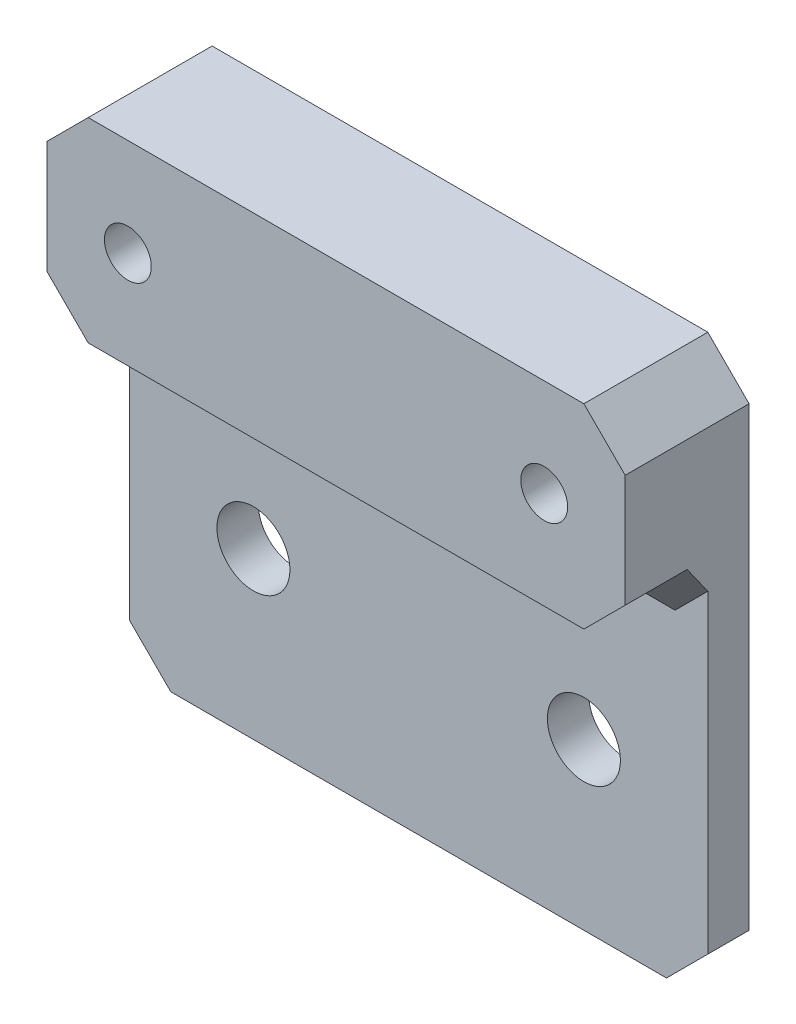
from build123d import *

# Parameters (mm, degrees)
BOSS_EXTRUDE1_DEPTH                              = 3.175
SKETCH2_W                                        = 44.45
SKETCH2_H                                        = 15
BOSS_EXTRUDE2_DEPTH                              = 6.35
CBORE_FOR_M3_HEX_HEAD_MACHINE_SCREW1_D           = 3.6
CBORE_FOR_M3_HEX_HEAD_MACHINE_SCREW1_CBORE_D     = 8.4
CBORE_FOR_M3_HEX_HEAD_MACHINE_SCREW1_CBORE_DEPTH = 2.3
CHAMFER2_SIZE                                    = 3.175
CHAMFER1_SIZE                                    = 1.5875
F_10_CLEARANCE_HOLE1_D                           = 5.6134


with BuildPart() as part:
    # Sketch1 → Boss-Extrude1 (new body)
    with BuildSketch(Plane.XY):
        Polygon((-22.225, 12.7), (-22.225, -12.7), (22.225, -12.7), (22.225, 12.7), (22.225, 13.7), (22.225, 28.7), (-22.225, 28.7), (-22.225, 13.7), align=None)
    extrude(amount=BOSS_EXTRUDE1_DEPTH)

    # Sketch2 → Boss-Extrude2 (add)
    with BuildSketch(Plane.XY.offset(3.175)):
        with Locations((0, 21.2)):
            Rectangle(SKETCH2_W, SKETCH2_H)
    extrude(amount=BOSS_EXTRUDE2_DEPTH)

    # CBORE for M3 Hex Head Machine Screw1 (through all)
    with Locations(Plane(origin=(0, 0, 0), x_dir=(-1, 0, 0), z_dir=(0, 0, -1))):
        with Locations((-16, 21.2), (16, 21.2)):
            CounterBoreHole(CBORE_FOR_M3_HEX_HEAD_MACHINE_SCREW1_D / 2, CBORE_FOR_M3_HEX_HEAD_MACHINE_SCREW1_CBORE_D / 2, CBORE_FOR_M3_HEX_HEAD_MACHINE_SCREW1_CBORE_DEPTH)

    # Chamfer2
    chamfer2_edges = [part.edges().sort_by_distance(p)[0] for p in [
        (22.225, -12.7, 1.5875),
        (-22.225, -12.7, 1.5875),
        (-22.225, 28.7, 4.7625),
        (22.225, 28.7, 4.7625),
        (-22.225, 13.7, 6.35),
        (22.225, 13.7, 6.35),
    ]]
    chamfer(chamfer2_edges, length=CHAMFER2_SIZE)

    # Chamfer1
    chamfer1_edges = [part.edges().sort_by_distance(p)[0] for p in [
        (0, 13.7, 3.175),
        (20.6375, 15.2875, 3.175),
        (-20.6375, 15.2875, 3.175),
    ]]
    chamfer(chamfer1_edges, length=CHAMFER1_SIZE)

    # 10 Clearance Hole1 (through all)
    with Locations(Plane.XY.offset(3.175)):
        with Locations((-12.7, 0), (12.7, 0)):
            Hole(F_10_CLEARANCE_HOLE1_D / 2)


solid = part.part
